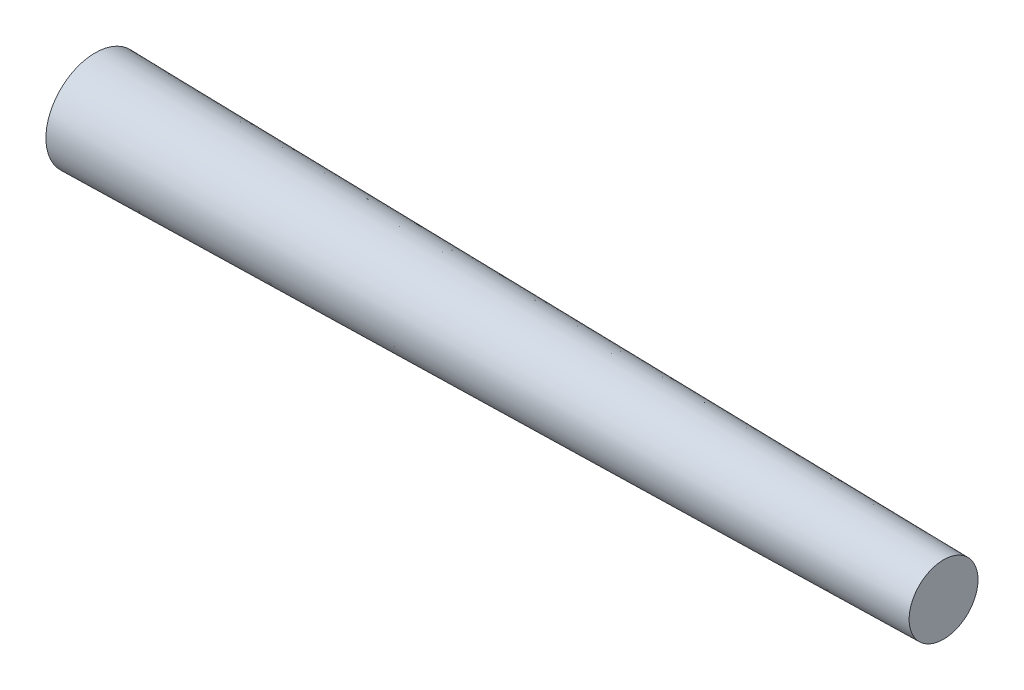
from build123d import *

# Parameters (mm, degrees)
SKETCH1_R           = 5.05
BOSS_EXTRUDE1_DEPTH = 87
BOSS_EXTRUDE1_TAPER = 1
SKETCH2_R           = 0.5
BOSS_EXTRUDE2_DEPTH = 0.5


with BuildPart() as part:
    # Sketch1 → Boss-Extrude1 (new body)
    with BuildSketch(Plane(origin=(0, 0, 0), x_dir=(0, 0, -1), z_dir=(1, 0, 0))):
        Circle(SKETCH1_R)
    extrude(amount=BOSS_EXTRUDE1_DEPTH, taper=BOSS_EXTRUDE1_TAPER)

    # Sketch2 → Boss-Extrude2 (add, symmetric)
    with BuildSketch(Plane(origin=(0, 0, 0), x_dir=(1, 0, 0), z_dir=(0, 1, 0))):
        with BuildLine():
            Line((0, 1), (-1, 1))
            ThreePointArc((-1, 1), (-2, 0), (-1, -1))
            Line((-1, -1), (0, -1))
            Line((0, -1), (0, 1))
        make_face()
        with Locations(Location((-1, 0, 0), (0, 0, 270))):
            Circle(SKETCH2_R, mode=Mode.SUBTRACT)
    extrude(amount=BOSS_EXTRUDE2_DEPTH, both=True)


solid = part.part
